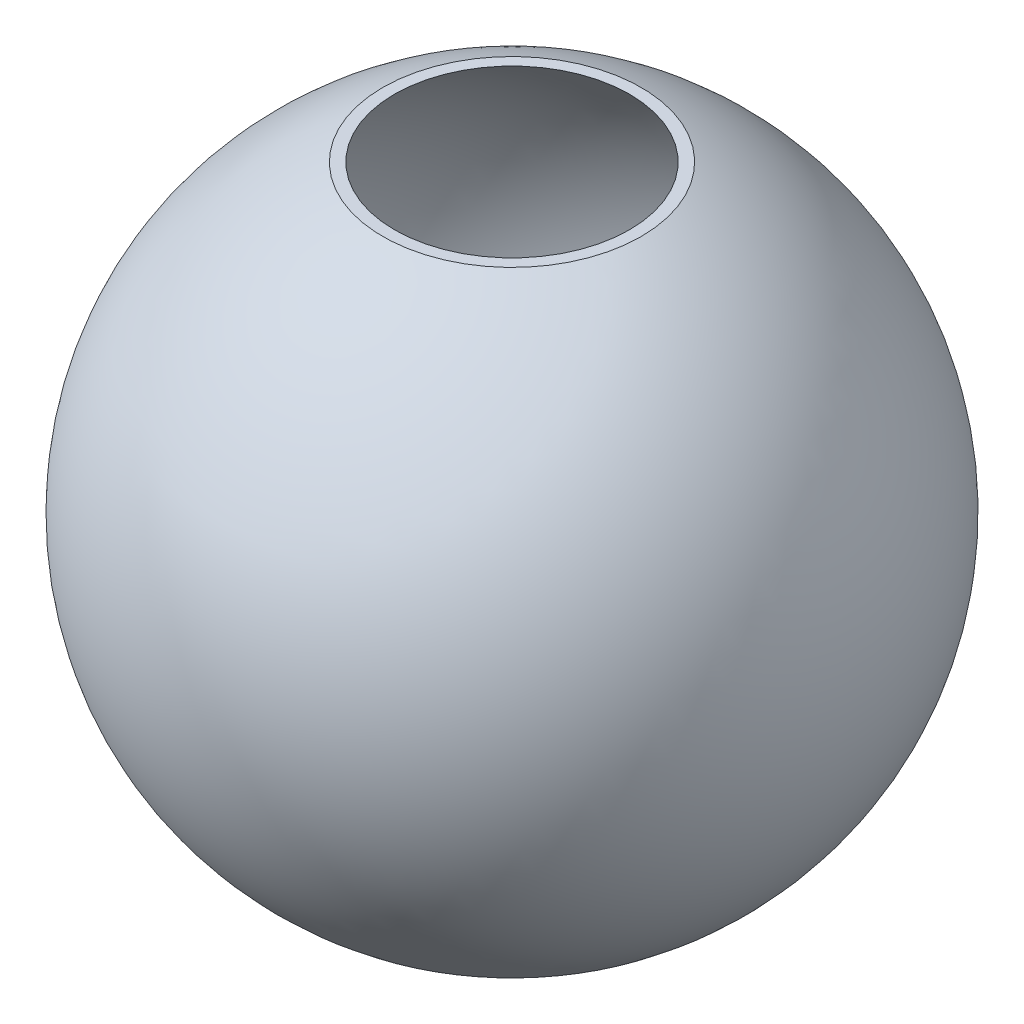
ISO-10303-21;
HEADER;
FILE_DESCRIPTION(('STEP AP214'),'2;1');
FILE_NAME('part.step','',(''),(''),'','','');
FILE_SCHEMA(('AUTOMOTIVE_DESIGN { 1 0 10303 214 1 1 1 1 }'));
ENDSEC;
DATA;
#1=APPLICATION_CONTEXT('core data for automotive mechanical design processes');
#2=APPLICATION_PROTOCOL_DEFINITION('international standard','automotive_design',2000,#1);
#3=PRODUCT_CONTEXT('',#1,'mechanical');
#4=PRODUCT('Part','Part','',(#3));
#5=PRODUCT_RELATED_PRODUCT_CATEGORY('part','',(#4));
#6=PRODUCT_DEFINITION_FORMATION('','',#4);
#7=PRODUCT_DEFINITION_CONTEXT('part definition',#1,'design');
#8=PRODUCT_DEFINITION('design','',#6,#7);
#9=PRODUCT_DEFINITION_SHAPE('','',#8);
#10=(LENGTH_UNIT() NAMED_UNIT(*) SI_UNIT(.MILLI.,.METRE.));
#11=(NAMED_UNIT(*) PLANE_ANGLE_UNIT() SI_UNIT($,.RADIAN.));
#12=(NAMED_UNIT(*) SI_UNIT($,.STERADIAN.) SOLID_ANGLE_UNIT());
#13=UNCERTAINTY_MEASURE_WITH_UNIT(LENGTH_MEASURE(1.E-05),#10,'distance_accuracy_value','');
#14=(GEOMETRIC_REPRESENTATION_CONTEXT(3) GLOBAL_UNCERTAINTY_ASSIGNED_CONTEXT((#13)) GLOBAL_UNIT_ASSIGNED_CONTEXT((#10,
#11,#12)) REPRESENTATION_CONTEXT('',''));
#15=CARTESIAN_POINT('',(0.,0.,0.));
#16=DIRECTION('',(0.,0.,1.));
#17=DIRECTION('',(1.,0.,0.));
#18=AXIS2_PLACEMENT_3D('',#15,#16,#17);
#19=CARTESIAN_POINT('',(0.,0.,0.));
#20=DIRECTION('',(0.,1.,0.));
#21=DIRECTION('',(1.,0.,0.));
#22=AXIS2_PLACEMENT_3D('',#19,#20,#21);
#23=SPHERICAL_SURFACE('',#22,75.);
#24=CARTESIAN_POINT('',(0.,69.,0.));
#25=DIRECTION('',(0.,1.,0.));
#26=DIRECTION('',(-1.,0.,0.));
#27=AXIS2_PLACEMENT_3D('',#24,#25,#26);
#28=CIRCLE('',#27,29.3938769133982);
#29=CARTESIAN_POINT('',(-29.3938769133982,69.,0.));
#30=VERTEX_POINT('',#29);
#31=EDGE_CURVE('E10',#30,#30,#28,.T.);
#32=ORIENTED_EDGE('',*,*,#31,.F.);
#33=EDGE_LOOP('',(#32));
#34=FACE_BOUND('',#33,.T.);
#35=ADVANCED_FACE('F37',(#34),#23,.T.);
#36=CARTESIAN_POINT('',(26.7394839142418,69.,0.));
#37=DIRECTION('',(0.,-1.,0.));
#38=DIRECTION('',(1.,0.,0.));
#39=AXIS2_PLACEMENT_3D('',#36,#37,#38);
#40=PLANE('',#39);
#41=CARTESIAN_POINT('',(0.,69.,0.));
#42=DIRECTION('',(0.,1.,0.));
#43=DIRECTION('',(-1.,0.,0.));
#44=AXIS2_PLACEMENT_3D('',#41,#42,#43);
#45=CIRCLE('',#44,26.7394839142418);
#46=CARTESIAN_POINT('',(-26.7394839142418,69.,0.));
#47=VERTEX_POINT('',#46);
#48=EDGE_CURVE('E43',#47,#47,#45,.T.);
#49=ORIENTED_EDGE('',*,*,#48,.F.);
#50=EDGE_LOOP('',(#49));
#51=FACE_BOUND('',#50,.T.);
#52=ORIENTED_EDGE('',*,*,#31,.T.);
#53=EDGE_LOOP('',(#52));
#54=FACE_BOUND('',#53,.T.);
#55=ADVANCED_FACE('F51',(#51,#54),#40,.F.);
#56=CARTESIAN_POINT('',(0.,0.,0.));
#57=DIRECTION('',(0.,1.,0.));
#58=DIRECTION('',(1.,0.,0.));
#59=AXIS2_PLACEMENT_3D('',#56,#57,#58);
#60=SPHERICAL_SURFACE('',#59,74.);
#61=ORIENTED_EDGE('',*,*,#48,.T.);
#62=EDGE_LOOP('',(#61));
#63=FACE_BOUND('',#62,.T.);
#64=ADVANCED_FACE('F49',(#63),#60,.F.);
#65=CLOSED_SHELL('',(#35,#55,#64));
#66=MANIFOLD_SOLID_BREP('B2',#65);
#67=ADVANCED_BREP_SHAPE_REPRESENTATION('',(#18,#66),#14);
#68=SHAPE_DEFINITION_REPRESENTATION(#9,#67);
ENDSEC;
END-ISO-10303-21;
